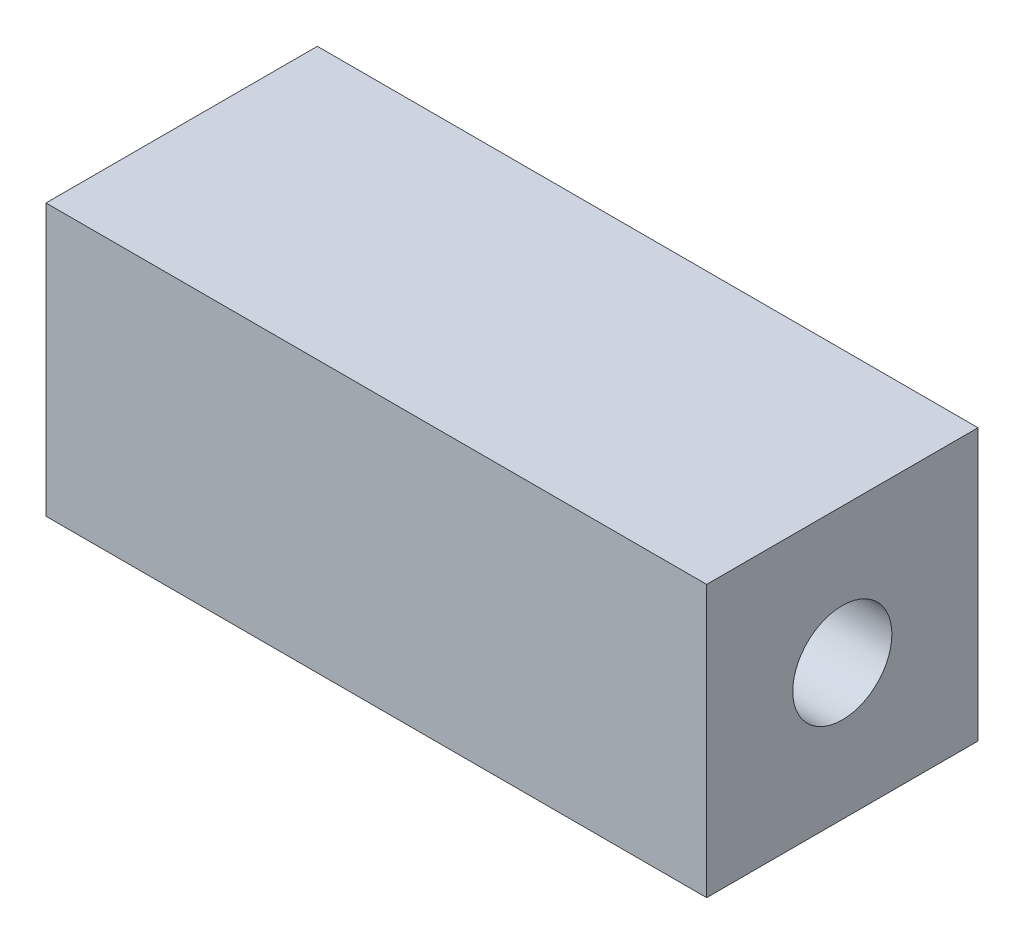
from build123d import *

# Parameters (mm, degrees)
SKETCH_1_W          = 11.5
SKETCH_1_H          = 11.5
SKETCH_1_R          = 2.1
EXTRUDE_1_DEPTH     = 28
SKETCH_2_R          = 2.1
CUT_EXTRUDE_1_DEPTH = 3.5


with BuildPart() as part:
    # Sketch 1 → Extrude 1 (new body)
    with BuildSketch(Plane(origin=(0, 0, 0), x_dir=(0, 0, -1), z_dir=(1, 0, 0))):
        with Locations((-6.211419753, -1.064814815)):
            Rectangle(SKETCH_1_W, SKETCH_1_H)
        with Locations((-6.211419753, -1.064814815)):
            Circle(SKETCH_1_R, mode=Mode.SUBTRACT)
    extrude(amount=EXTRUDE_1_DEPTH)

    # Sketch 2 → Cut-Extrude 1 (cut)
    with BuildSketch(Plane.ZY):
        Polygon((2.749947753, 1.210684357), (6.211419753, 2.705717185), (9.672891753, 1.210684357), (9.672891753, -3.340313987), (6.211419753, -4.835346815), (2.749947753, -3.340313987), align=None)
        with Locations((6.211419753, -1.064814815)):
            Circle(SKETCH_2_R, mode=Mode.SUBTRACT)
    extrude(amount=-CUT_EXTRUDE_1_DEPTH, mode=Mode.SUBTRACT)


solid = part.part
